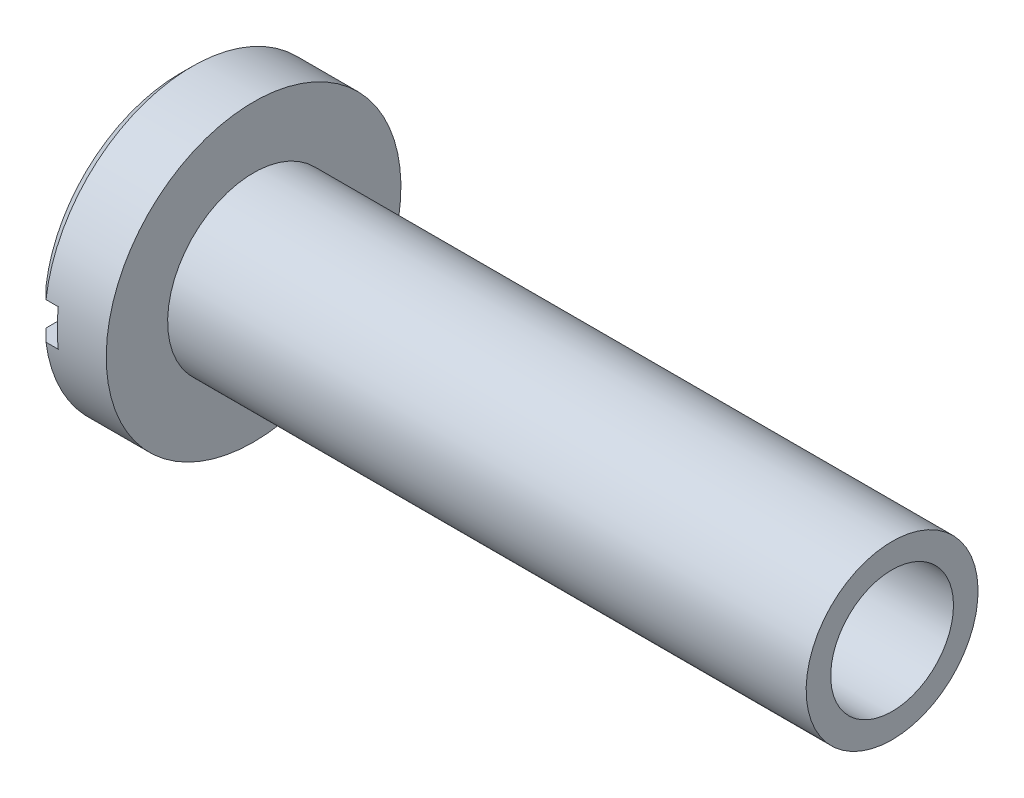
ISO-10303-21;
HEADER;
FILE_DESCRIPTION(('STEP AP214'),'2;1');
FILE_NAME('part.step','',(''),(''),'','','');
FILE_SCHEMA(('AUTOMOTIVE_DESIGN { 1 0 10303 214 1 1 1 1 }'));
ENDSEC;
DATA;
#1=APPLICATION_CONTEXT('core data for automotive mechanical design processes');
#2=APPLICATION_PROTOCOL_DEFINITION('international standard','automotive_design',2000,#1);
#3=PRODUCT_CONTEXT('',#1,'mechanical');
#4=PRODUCT('Part','Part','',(#3));
#5=PRODUCT_RELATED_PRODUCT_CATEGORY('part','',(#4));
#6=PRODUCT_DEFINITION_FORMATION('','',#4);
#7=PRODUCT_DEFINITION_CONTEXT('part definition',#1,'design');
#8=PRODUCT_DEFINITION('design','',#6,#7);
#9=PRODUCT_DEFINITION_SHAPE('','',#8);
#10=(LENGTH_UNIT() NAMED_UNIT(*) SI_UNIT(.MILLI.,.METRE.));
#11=(NAMED_UNIT(*) PLANE_ANGLE_UNIT() SI_UNIT($,.RADIAN.));
#12=(NAMED_UNIT(*) SI_UNIT($,.STERADIAN.) SOLID_ANGLE_UNIT());
#13=UNCERTAINTY_MEASURE_WITH_UNIT(LENGTH_MEASURE(1.E-05),#10,'distance_accuracy_value','');
#14=(GEOMETRIC_REPRESENTATION_CONTEXT(3) GLOBAL_UNCERTAINTY_ASSIGNED_CONTEXT((#13)) GLOBAL_UNIT_ASSIGNED_CONTEXT((#10,
#11,#12)) REPRESENTATION_CONTEXT('',''));
#15=CARTESIAN_POINT('',(0.,0.,0.));
#16=DIRECTION('',(0.,0.,1.));
#17=DIRECTION('',(1.,0.,0.));
#18=AXIS2_PLACEMENT_3D('',#15,#16,#17);
#19=CARTESIAN_POINT('',(0.,0.,0.));
#20=DIRECTION('',(0.999999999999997,0.,0.));
#21=DIRECTION('',(0.,1.,0.));
#22=AXIS2_PLACEMENT_3D('',#19,#20,#21);
#23=PLANE('',#22);
#24=DIRECTION('',(0.,0.,0.999999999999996));
#25=VECTOR('',#24,1.);
#26=CARTESIAN_POINT('',(0.,0.375000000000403,-2.99999999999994));
#27=LINE('',#26,#25);
#28=CARTESIAN_POINT('',(0.,0.375000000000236,-2.72431183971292));
#29=VERTEX_POINT('',#28);
#30=CARTESIAN_POINT('',(0.,0.374999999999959,2.72431183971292));
#31=VERTEX_POINT('',#30);
#32=EDGE_CURVE('E185',#29,#31,#27,.T.);
#33=ORIENTED_EDGE('',*,*,#32,.T.);
#34=CARTESIAN_POINT('',(0.,0.,0.));
#35=DIRECTION('',(0.999999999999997,0.,0.));
#36=DIRECTION('',(0.,1.,0.));
#37=AXIS2_PLACEMENT_3D('',#34,#35,#36);
#38=CIRCLE('',#37,2.75);
#39=EDGE_CURVE('E133',#31,#29,#38,.F.);
#40=ORIENTED_EDGE('',*,*,#39,.T.);
#41=EDGE_LOOP('',(#33,#40));
#42=FACE_BOUND('',#41,.T.);
#43=ADVANCED_FACE('F38',(#42),#23,.F.);
#44=DIRECTION('',(0.,0.,0.999999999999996));
#45=VECTOR('',#44,1.);
#46=CARTESIAN_POINT('',(0.,-0.375000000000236,-3.00000000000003));
#47=LINE('',#46,#45);
#48=CARTESIAN_POINT('',(0.,-0.375000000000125,-2.72431183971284));
#49=VERTEX_POINT('',#48);
#50=CARTESIAN_POINT('',(0.,-0.375000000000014,2.7243118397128));
#51=VERTEX_POINT('',#50);
#52=EDGE_CURVE('E114',#49,#51,#47,.T.);
#53=ORIENTED_EDGE('',*,*,#52,.F.);
#54=CARTESIAN_POINT('',(0.,0.,0.));
#55=DIRECTION('',(0.999999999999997,0.,0.));
#56=DIRECTION('',(0.,1.,0.));
#57=AXIS2_PLACEMENT_3D('',#54,#55,#56);
#58=CIRCLE('',#57,2.75);
#59=EDGE_CURVE('E167',#49,#51,#58,.F.);
#60=ORIENTED_EDGE('',*,*,#59,.T.);
#61=EDGE_LOOP('',(#53,#60));
#62=FACE_BOUND('',#61,.T.);
#63=ADVANCED_FACE('F40',(#62),#23,.F.);
#64=CARTESIAN_POINT('',(0.,0.,0.));
#65=DIRECTION('',(-0.999999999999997,0.,0.));
#66=DIRECTION('',(0.,-1.,0.));
#67=AXIS2_PLACEMENT_3D('',#64,#65,#66);
#68=CYLINDRICAL_SURFACE('',#67,3.);
#69=DIRECTION('',(-0.999999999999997,0.,0.));
#70=VECTOR('',#69,1.);
#71=CARTESIAN_POINT('',(0.,0.375000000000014,-2.97647022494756));
#72=LINE('',#71,#70);
#73=CARTESIAN_POINT('',(0.500000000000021,0.375000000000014,-2.97647022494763));
#74=VERTEX_POINT('',#73);
#75=CARTESIAN_POINT('',(0.250000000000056,0.374999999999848,-2.97647022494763));
#76=VERTEX_POINT('',#75);
#77=EDGE_CURVE('E129',#74,#76,#72,.T.);
#78=ORIENTED_EDGE('',*,*,#77,.T.);
#79=CARTESIAN_POINT('',(0.25,2.77555756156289E-13,0.));
#80=DIRECTION('',(0.999999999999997,0.,0.));
#81=DIRECTION('',(0.,1.,0.));
#82=AXIS2_PLACEMENT_3D('',#79,#80,#81);
#83=CIRCLE('',#82,3.);
#84=CARTESIAN_POINT('',(0.250000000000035,0.375000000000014,2.97647022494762));
#85=VERTEX_POINT('',#84);
#86=EDGE_CURVE('E191',#76,#85,#83,.T.);
#87=ORIENTED_EDGE('',*,*,#86,.T.);
#88=DIRECTION('',(-0.999999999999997,0.,0.));
#89=VECTOR('',#88,1.);
#90=CARTESIAN_POINT('',(0.,0.37500000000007,2.9764702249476));
#91=LINE('',#90,#89);
#92=CARTESIAN_POINT('',(0.500000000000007,0.374999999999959,2.9764702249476));
#93=VERTEX_POINT('',#92);
#94=EDGE_CURVE('E120',#85,#93,#91,.F.);
#95=ORIENTED_EDGE('',*,*,#94,.T.);
#96=CARTESIAN_POINT('',(0.500000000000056,1.11022302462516E-13,0.));
#97=DIRECTION('',(0.999999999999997,0.,0.));
#98=DIRECTION('',(0.,0.,-0.999999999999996));
#99=AXIS2_PLACEMENT_3D('',#96,#97,#98);
#100=CIRCLE('',#99,3.);
#101=CARTESIAN_POINT('',(0.499999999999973,-0.374999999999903,2.97647022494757));
#102=VERTEX_POINT('',#101);
#103=EDGE_CURVE('E106',#93,#102,#100,.T.);
#104=ORIENTED_EDGE('',*,*,#103,.T.);
#105=DIRECTION('',(-0.999999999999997,0.,0.));
#106=VECTOR('',#105,1.);
#107=CARTESIAN_POINT('',(0.,-0.37500000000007,2.97647022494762));
#108=LINE('',#107,#106);
#109=CARTESIAN_POINT('',(0.250000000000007,-0.374999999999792,2.97647022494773));
#110=VERTEX_POINT('',#109);
#111=EDGE_CURVE('E98',#102,#110,#108,.T.);
#112=ORIENTED_EDGE('',*,*,#111,.T.);
#113=CARTESIAN_POINT('',(0.25,2.77555756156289E-13,0.));
#114=DIRECTION('',(0.999999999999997,0.,0.));
#115=DIRECTION('',(0.,1.,0.));
#116=AXIS2_PLACEMENT_3D('',#113,#114,#115);
#117=CIRCLE('',#116,3.);
#118=CARTESIAN_POINT('',(0.249999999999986,-0.375000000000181,-2.97647022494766));
#119=VERTEX_POINT('',#118);
#120=EDGE_CURVE('E192',#110,#119,#117,.T.);
#121=ORIENTED_EDGE('',*,*,#120,.T.);
#122=DIRECTION('',(-0.999999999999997,0.,0.));
#123=VECTOR('',#122,1.);
#124=CARTESIAN_POINT('',(0.,-0.37500000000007,-2.97647022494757));
#125=LINE('',#124,#123);
#126=CARTESIAN_POINT('',(0.500000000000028,-0.375000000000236,-2.97647022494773));
#127=VERTEX_POINT('',#126);
#128=EDGE_CURVE('E126',#119,#127,#125,.F.);
#129=ORIENTED_EDGE('',*,*,#128,.T.);
#130=EDGE_CURVE('E105',#127,#74,#100,.T.);
#131=ORIENTED_EDGE('',*,*,#130,.T.);
#132=EDGE_LOOP('',(#78,#87,#95,#104,#112,#121,#129,#131));
#133=FACE_BOUND('',#132,.T.);
#134=CARTESIAN_POINT('',(1.50000000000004,1.66533453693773E-13,0.));
#135=DIRECTION('',(-0.999999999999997,0.,0.));
#136=DIRECTION('',(0.,-1.,0.));
#137=AXIS2_PLACEMENT_3D('',#134,#135,#136);
#138=CIRCLE('',#137,3.);
#139=CARTESIAN_POINT('',(1.50000000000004,-2.99999999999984,0.));
#140=VERTEX_POINT('',#139);
#141=EDGE_CURVE('E121',#140,#140,#138,.T.);
#142=ORIENTED_EDGE('',*,*,#141,.T.);
#143=EDGE_LOOP('',(#142));
#144=FACE_BOUND('',#143,.T.);
#145=ADVANCED_FACE('F117',(#133,#144),#68,.T.);
#146=CARTESIAN_POINT('',(1.49999999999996,3.00000000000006,-1.11022302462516E-13));
#147=DIRECTION('',(-0.999999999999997,0.,0.));
#148=DIRECTION('',(0.,-1.,0.));
#149=AXIS2_PLACEMENT_3D('',#146,#147,#148);
#150=PLANE('',#149);
#151=ORIENTED_EDGE('',*,*,#141,.F.);
#152=EDGE_LOOP('',(#151));
#153=FACE_BOUND('',#152,.T.);
#154=CARTESIAN_POINT('',(1.50000000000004,1.66533453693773E-13,0.));
#155=DIRECTION('',(-0.999999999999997,0.,0.));
#156=DIRECTION('',(0.,-1.,0.));
#157=AXIS2_PLACEMENT_3D('',#154,#155,#156);
#158=CIRCLE('',#157,1.75);
#159=CARTESIAN_POINT('',(1.50000000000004,-1.75,0.));
#160=VERTEX_POINT('',#159);
#161=EDGE_CURVE('E124',#160,#160,#158,.T.);
#162=ORIENTED_EDGE('',*,*,#161,.T.);
#163=EDGE_LOOP('',(#162));
#164=FACE_BOUND('',#163,.T.);
#165=ADVANCED_FACE('F213',(#153,#164),#150,.F.);
#166=CARTESIAN_POINT('',(0.,0.,0.));
#167=DIRECTION('',(-0.999999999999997,0.,0.));
#168=DIRECTION('',(0.,-1.,0.));
#169=AXIS2_PLACEMENT_3D('',#166,#167,#168);
#170=CYLINDRICAL_SURFACE('',#169,1.75);
#171=CARTESIAN_POINT('',(14.4999999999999,1.11022302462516E-13,1.38777878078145E-13));
#172=DIRECTION('',(-0.999999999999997,0.,0.));
#173=DIRECTION('',(0.,-1.,0.));
#174=AXIS2_PLACEMENT_3D('',#171,#172,#173);
#175=CIRCLE('',#174,1.75);
#176=CARTESIAN_POINT('',(14.4999999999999,-1.75000000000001,0.));
#177=VERTEX_POINT('',#176);
#178=EDGE_CURVE('E207',#177,#177,#175,.T.);
#179=CARTESIAN_POINT('',(1.50000000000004,-1.75,0.));
#180=CARTESIAN_POINT('',(1.63541666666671,-1.75,0.));
#181=CARTESIAN_POINT('',(1.77083333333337,-1.75,0.));
#182=CARTESIAN_POINT('',(2.0416666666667,-1.75,0.));
#183=CARTESIAN_POINT('',(2.17708333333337,-1.75,0.));
#184=CARTESIAN_POINT('',(2.4479166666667,-1.75,0.));
#185=CARTESIAN_POINT('',(2.58333333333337,-1.75,0.));
#186=CARTESIAN_POINT('',(2.8541666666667,-1.75,0.));
#187=CARTESIAN_POINT('',(2.98958333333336,-1.75,0.));
#188=CARTESIAN_POINT('',(3.26041666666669,-1.75,0.));
#189=CARTESIAN_POINT('',(3.39583333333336,-1.75,0.));
#190=CARTESIAN_POINT('',(3.66666666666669,-1.75,0.));
#191=CARTESIAN_POINT('',(3.80208333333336,-1.75000000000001,0.));
#192=CARTESIAN_POINT('',(4.07291666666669,-1.75000000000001,0.));
#193=CARTESIAN_POINT('',(4.20833333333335,-1.75000000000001,0.));
#194=CARTESIAN_POINT('',(4.47916666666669,-1.75000000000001,0.));
#195=CARTESIAN_POINT('',(4.61458333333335,-1.75000000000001,0.));
#196=CARTESIAN_POINT('',(4.88541666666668,-1.75000000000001,0.));
#197=CARTESIAN_POINT('',(5.02083333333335,-1.75000000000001,0.));
#198=CARTESIAN_POINT('',(5.29166666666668,-1.75000000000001,0.));
#199=CARTESIAN_POINT('',(5.42708333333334,-1.75000000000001,0.));
#200=CARTESIAN_POINT('',(5.69791666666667,-1.75000000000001,0.));
#201=CARTESIAN_POINT('',(5.83333333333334,-1.75000000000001,0.));
#202=CARTESIAN_POINT('',(6.10416666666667,-1.75000000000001,0.));
#203=CARTESIAN_POINT('',(6.23958333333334,-1.75000000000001,0.));
#204=CARTESIAN_POINT('',(6.51041666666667,-1.75000000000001,0.));
#205=CARTESIAN_POINT('',(6.64583333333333,-1.75000000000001,0.));
#206=CARTESIAN_POINT('',(6.91666666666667,-1.75000000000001,0.));
#207=CARTESIAN_POINT('',(7.05208333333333,-1.75000000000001,0.));
#208=CARTESIAN_POINT('',(7.32291666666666,-1.75000000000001,0.));
#209=CARTESIAN_POINT('',(7.45833333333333,-1.75000000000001,0.));
#210=CARTESIAN_POINT('',(7.72916666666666,-1.75000000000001,0.));
#211=CARTESIAN_POINT('',(7.86458333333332,-1.75000000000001,0.));
#212=CARTESIAN_POINT('',(8.13541666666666,-1.75000000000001,0.));
#213=CARTESIAN_POINT('',(8.27083333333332,-1.75000000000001,0.));
#214=CARTESIAN_POINT('',(8.54166666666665,-1.75000000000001,0.));
#215=CARTESIAN_POINT('',(8.67708333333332,-1.75000000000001,0.));
#216=CARTESIAN_POINT('',(8.94791666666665,-1.75000000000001,0.));
#217=CARTESIAN_POINT('',(9.08333333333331,-1.75000000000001,0.));
#218=CARTESIAN_POINT('',(9.35416666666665,-1.75000000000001,0.));
#219=CARTESIAN_POINT('',(9.48958333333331,-1.75000000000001,0.));
#220=CARTESIAN_POINT('',(9.76041666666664,-1.75000000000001,0.));
#221=CARTESIAN_POINT('',(9.89583333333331,-1.75000000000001,0.));
#222=CARTESIAN_POINT('',(10.1666666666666,-1.75000000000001,0.));
#223=CARTESIAN_POINT('',(10.3020833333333,-1.75000000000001,0.));
#224=CARTESIAN_POINT('',(10.5729166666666,-1.75000000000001,0.));
#225=CARTESIAN_POINT('',(10.7083333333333,-1.75000000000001,0.));
#226=CARTESIAN_POINT('',(10.9791666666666,-1.75000000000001,0.));
#227=CARTESIAN_POINT('',(11.1145833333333,-1.75000000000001,0.));
#228=CARTESIAN_POINT('',(11.3854166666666,-1.75000000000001,0.));
#229=CARTESIAN_POINT('',(11.5208333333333,-1.75000000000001,0.));
#230=CARTESIAN_POINT('',(11.7916666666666,-1.75000000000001,0.));
#231=CARTESIAN_POINT('',(11.9270833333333,-1.75000000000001,0.));
#232=CARTESIAN_POINT('',(12.1979166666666,-1.75000000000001,0.));
#233=CARTESIAN_POINT('',(12.3333333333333,-1.75000000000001,0.));
#234=CARTESIAN_POINT('',(12.6041666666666,-1.75000000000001,0.));
#235=CARTESIAN_POINT('',(12.7395833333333,-1.75000000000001,0.));
#236=CARTESIAN_POINT('',(13.0104166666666,-1.75000000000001,0.));
#237=CARTESIAN_POINT('',(13.1458333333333,-1.75000000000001,0.));
#238=CARTESIAN_POINT('',(13.4166666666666,-1.75000000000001,0.));
#239=CARTESIAN_POINT('',(13.5520833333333,-1.75000000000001,0.));
#240=CARTESIAN_POINT('',(13.8229166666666,-1.75000000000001,0.));
#241=CARTESIAN_POINT('',(13.9583333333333,-1.75000000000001,0.));
#242=CARTESIAN_POINT('',(14.2291666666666,-1.75000000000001,0.));
#243=CARTESIAN_POINT('',(14.3645833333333,-1.75000000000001,0.));
#244=CARTESIAN_POINT('',(14.4999999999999,-1.75000000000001,0.));
#245=B_SPLINE_CURVE_WITH_KNOTS('',3,(#179,#180,#181,#182,#183,#184,#185,#186,#187,#188,#189,
#190,#191,#192,#193,#194,#195,#196,#197,#198,#199,#200,#201,#202,#203,#204,#205,#206,#207,#208,
#209,#210,#211,#212,#213,#214,#215,#216,#217,#218,#219,#220,#221,#222,#223,#224,#225,#226,#227,
#228,#229,#230,#231,#232,#233,#234,#235,#236,#237,#238,#239,#240,#241,#242,#243,#244),
.UNSPECIFIED.,.F.,.F.,(4,2,2,2,2,2,2,2,2,2,2,2,2,2,2,2,2,2,2,2,2,2,2,2,2,2,2,2,2,2,2,2,4),(0.,
0.406249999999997,0.812499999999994,1.21874999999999,1.62499999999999,2.03124999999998,
2.43749999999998,2.84374999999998,3.24999999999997,3.65624999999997,4.06249999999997,
4.46874999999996,4.87499999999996,5.28124999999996,5.68749999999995,6.09374999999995,
6.49999999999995,6.90624999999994,7.31249999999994,7.71874999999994,8.12499999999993,
8.53124999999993,8.93749999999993,9.34374999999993,9.74999999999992,10.1562499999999,
10.5624999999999,10.9687499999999,11.3749999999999,11.7812499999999,12.1874999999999,
12.5937499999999,12.9999999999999),.UNSPECIFIED.);
#246=EDGE_CURVE('BSEAM215',#160,#177,#245,.T.);
#247=ORIENTED_EDGE('',*,*,#161,.F.);
#248=ORIENTED_EDGE('',*,*,#178,.T.);
#249=ORIENTED_EDGE('',*,*,#246,.T.);
#250=ORIENTED_EDGE('',*,*,#246,.F.);
#251=EDGE_LOOP('',(#247,#249,#248,#250));
#252=FACE_BOUND('',#251,.T.);
#253=ADVANCED_FACE('F215',(#252),#170,.T.);
#254=CARTESIAN_POINT('',(14.5,1.75000000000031,0.));
#255=DIRECTION('',(-0.999999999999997,0.,0.));
#256=DIRECTION('',(0.,-1.,0.));
#257=AXIS2_PLACEMENT_3D('',#254,#255,#256);
#258=PLANE('',#257);
#259=CARTESIAN_POINT('',(14.4999999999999,1.11022302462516E-13,1.38777878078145E-13));
#260=DIRECTION('',(0.999999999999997,0.,0.));
#261=DIRECTION('',(0.,0.,-0.999999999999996));
#262=AXIS2_PLACEMENT_3D('',#259,#260,#261);
#263=CIRCLE('',#262,1.25);
#264=CARTESIAN_POINT('',(14.4999999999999,1.12886130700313E-13,-1.24999999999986));
#265=VERTEX_POINT('',#264);
#266=EDGE_CURVE('E204',#265,#265,#263,.T.);
#267=ORIENTED_EDGE('',*,*,#266,.F.);
#268=EDGE_LOOP('',(#267));
#269=FACE_BOUND('',#268,.T.);
#270=ORIENTED_EDGE('',*,*,#178,.F.);
#271=EDGE_LOOP('',(#270));
#272=FACE_BOUND('',#271,.T.);
#273=ADVANCED_FACE('F218',(#269,#272),#258,.F.);
#274=CARTESIAN_POINT('',(14.4999999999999,1.11022302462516E-13,1.38777878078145E-13));
#275=DIRECTION('',(0.999999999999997,0.,0.));
#276=DIRECTION('',(0.,0.,-0.999999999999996));
#277=AXIS2_PLACEMENT_3D('',#274,#275,#276);
#278=CYLINDRICAL_SURFACE('',#277,1.25);
#279=CARTESIAN_POINT('',(8.50000000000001,2.77555756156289E-13,0.));
#280=DIRECTION('',(0.999999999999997,0.,0.));
#281=DIRECTION('',(0.,0.,-0.999999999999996));
#282=AXIS2_PLACEMENT_3D('',#279,#280,#281);
#283=CIRCLE('',#282,1.25);
#284=CARTESIAN_POINT('',(8.50000000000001,1.15947849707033E-13,-1.24999999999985));
#285=VERTEX_POINT('',#284);
#286=EDGE_CURVE('E201',#285,#285,#283,.T.);
#287=CARTESIAN_POINT('',(8.50000000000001,1.15947849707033E-13,-1.24999999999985));
#288=CARTESIAN_POINT('',(8.56250000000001,1.15915956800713E-13,-1.24999999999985));
#289=CARTESIAN_POINT('',(8.62500000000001,1.15884063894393E-13,-1.24999999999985));
#290=CARTESIAN_POINT('',(8.75000000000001,1.15820278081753E-13,-1.24999999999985));
#291=CARTESIAN_POINT('',(8.8125,1.15788385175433E-13,-1.24999999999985));
#292=CARTESIAN_POINT('',(8.9375,1.15724599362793E-13,-1.24999999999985));
#293=CARTESIAN_POINT('',(9.,1.15692706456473E-13,-1.24999999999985));
#294=CARTESIAN_POINT('',(9.125,1.15628920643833E-13,-1.24999999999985));
#295=CARTESIAN_POINT('',(9.1875,1.15597027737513E-13,-1.24999999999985));
#296=CARTESIAN_POINT('',(9.3125,1.15533241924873E-13,-1.24999999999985));
#297=CARTESIAN_POINT('',(9.375,1.15501349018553E-13,-1.24999999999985));
#298=CARTESIAN_POINT('',(9.5,1.15437563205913E-13,-1.24999999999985));
#299=CARTESIAN_POINT('',(9.5625,1.15405670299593E-13,-1.24999999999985));
#300=CARTESIAN_POINT('',(9.68749999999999,1.15341884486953E-13,-1.24999999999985));
#301=CARTESIAN_POINT('',(9.74999999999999,1.15309991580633E-13,-1.24999999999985));
#302=CARTESIAN_POINT('',(9.87499999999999,1.15246205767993E-13,-1.24999999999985));
#303=CARTESIAN_POINT('',(9.93749999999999,1.15214312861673E-13,-1.24999999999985));
#304=CARTESIAN_POINT('',(10.0625,1.15150527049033E-13,-1.24999999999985));
#305=CARTESIAN_POINT('',(10.125,1.15118634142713E-13,-1.24999999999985));
#306=CARTESIAN_POINT('',(10.25,1.15054848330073E-13,-1.24999999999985));
#307=CARTESIAN_POINT('',(10.3125,1.15022955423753E-13,-1.24999999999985));
#308=CARTESIAN_POINT('',(10.4375,1.14959169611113E-13,-1.24999999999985));
#309=CARTESIAN_POINT('',(10.5,1.14927276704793E-13,-1.24999999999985));
#310=CARTESIAN_POINT('',(10.625,1.14863490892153E-13,-1.24999999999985));
#311=CARTESIAN_POINT('',(10.6875,1.14831597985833E-13,-1.24999999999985));
#312=CARTESIAN_POINT('',(10.8125,1.14767812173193E-13,-1.24999999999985));
#313=CARTESIAN_POINT('',(10.875,1.14735919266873E-13,-1.24999999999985));
#314=CARTESIAN_POINT('',(11.,1.14672133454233E-13,-1.24999999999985));
#315=CARTESIAN_POINT('',(11.0625,1.14640240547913E-13,-1.24999999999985));
#316=CARTESIAN_POINT('',(11.1875,1.14576454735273E-13,-1.24999999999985));
#317=CARTESIAN_POINT('',(11.25,1.14544561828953E-13,-1.24999999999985));
#318=CARTESIAN_POINT('',(11.375,1.14480776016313E-13,-1.24999999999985));
#319=CARTESIAN_POINT('',(11.4375,1.14448883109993E-13,-1.24999999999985));
#320=CARTESIAN_POINT('',(11.5625,1.14385097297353E-13,-1.24999999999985));
#321=CARTESIAN_POINT('',(11.625,1.14353204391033E-13,-1.24999999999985));
#322=CARTESIAN_POINT('',(11.75,1.14289418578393E-13,-1.24999999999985));
#323=CARTESIAN_POINT('',(11.8125,1.14257525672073E-13,-1.24999999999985));
#324=CARTESIAN_POINT('',(11.9375,1.14193739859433E-13,-1.24999999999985));
#325=CARTESIAN_POINT('',(12.,1.14161846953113E-13,-1.24999999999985));
#326=CARTESIAN_POINT('',(12.125,1.14098061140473E-13,-1.24999999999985));
#327=CARTESIAN_POINT('',(12.1875,1.14066168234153E-13,-1.24999999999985));
#328=CARTESIAN_POINT('',(12.3125,1.14002382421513E-13,-1.24999999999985));
#329=CARTESIAN_POINT('',(12.375,1.13970489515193E-13,-1.24999999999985));
#330=CARTESIAN_POINT('',(12.5,1.13906703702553E-13,-1.24999999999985));
#331=CARTESIAN_POINT('',(12.5625,1.13874810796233E-13,-1.24999999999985));
#332=CARTESIAN_POINT('',(12.6875,1.13811024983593E-13,-1.24999999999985));
#333=CARTESIAN_POINT('',(12.75,1.13779132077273E-13,-1.24999999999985));
#334=CARTESIAN_POINT('',(12.875,1.13715346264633E-13,-1.24999999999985));
#335=CARTESIAN_POINT('',(12.9375,1.13683453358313E-13,-1.24999999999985));
#336=CARTESIAN_POINT('',(13.0625,1.13619667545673E-13,-1.24999999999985));
#337=CARTESIAN_POINT('',(13.125,1.13587774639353E-13,-1.24999999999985));
#338=CARTESIAN_POINT('',(13.25,1.13523988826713E-13,-1.24999999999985));
#339=CARTESIAN_POINT('',(13.3125,1.13492095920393E-13,-1.24999999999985));
#340=CARTESIAN_POINT('',(13.4375,1.13428310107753E-13,-1.24999999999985));
#341=CARTESIAN_POINT('',(13.5,1.13396417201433E-13,-1.24999999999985));
#342=CARTESIAN_POINT('',(13.6249999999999,1.13332631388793E-13,-1.24999999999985));
#343=CARTESIAN_POINT('',(13.6874999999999,1.13300738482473E-13,-1.24999999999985));
#344=CARTESIAN_POINT('',(13.8124999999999,1.13236952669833E-13,-1.24999999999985));
#345=CARTESIAN_POINT('',(13.8749999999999,1.13205059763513E-13,-1.24999999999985));
#346=CARTESIAN_POINT('',(13.9999999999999,1.13141273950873E-13,-1.24999999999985));
#347=CARTESIAN_POINT('',(14.0624999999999,1.13109381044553E-13,-1.24999999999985));
#348=CARTESIAN_POINT('',(14.1874999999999,1.13045595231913E-13,-1.24999999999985));
#349=CARTESIAN_POINT('',(14.2499999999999,1.13013702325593E-13,-1.24999999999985));
#350=CARTESIAN_POINT('',(14.3749999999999,1.12949916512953E-13,-1.24999999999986));
#351=CARTESIAN_POINT('',(14.4374999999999,1.12918023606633E-13,-1.24999999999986));
#352=CARTESIAN_POINT('',(14.4999999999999,1.12886130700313E-13,-1.24999999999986));
#353=B_SPLINE_CURVE_WITH_KNOTS('',3,(#287,#288,#289,#290,#291,#292,#293,#294,#295,#296,#297,
#298,#299,#300,#301,#302,#303,#304,#305,#306,#307,#308,#309,#310,#311,#312,#313,#314,#315,#316,
#317,#318,#319,#320,#321,#322,#323,#324,#325,#326,#327,#328,#329,#330,#331,#332,#333,#334,#335,
#336,#337,#338,#339,#340,#341,#342,#343,#344,#345,#346,#347,#348,#349,#350,#351,#352),
.UNSPECIFIED.,.F.,.F.,(4,2,2,2,2,2,2,2,2,2,2,2,2,2,2,2,2,2,2,2,2,2,2,2,2,2,2,2,2,2,2,2,4),(0.,
0.187499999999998,0.374999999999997,0.562499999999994,0.749999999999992,0.93749999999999,
1.12499999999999,1.31249999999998,1.49999999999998,1.68749999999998,1.87499999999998,
2.06249999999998,2.24999999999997,2.43749999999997,2.62499999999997,2.81249999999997,
2.99999999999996,3.18749999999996,3.37499999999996,3.56249999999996,3.74999999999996,
3.93749999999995,4.12499999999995,4.31249999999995,4.49999999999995,4.68749999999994,
4.87499999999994,5.06249999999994,5.24999999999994,5.43749999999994,5.62499999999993,
5.81249999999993,5.99999999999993),.UNSPECIFIED.);
#354=EDGE_CURVE('BSEAM223',#285,#265,#353,.T.);
#355=ORIENTED_EDGE('',*,*,#286,.F.);
#356=ORIENTED_EDGE('',*,*,#266,.T.);
#357=ORIENTED_EDGE('',*,*,#354,.T.);
#358=ORIENTED_EDGE('',*,*,#354,.F.);
#359=EDGE_LOOP('',(#355,#357,#356,#358));
#360=FACE_BOUND('',#359,.T.);
#361=ADVANCED_FACE('F223',(#360),#278,.F.);
#362=CARTESIAN_POINT('',(8.49999999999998,1.02500000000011,0.));
#363=DIRECTION('',(-0.999999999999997,0.,0.));
#364=DIRECTION('',(0.,0.,0.999999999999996));
#365=AXIS2_PLACEMENT_3D('',#362,#363,#364);
#366=PLANE('',#365);
#367=CARTESIAN_POINT('',(8.50000000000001,2.77555756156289E-13,0.));
#368=DIRECTION('',(0.999999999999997,0.,0.));
#369=DIRECTION('',(0.,0.,-0.999999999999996));
#370=AXIS2_PLACEMENT_3D('',#367,#368,#369);
#371=CIRCLE('',#370,1.025);
#372=CARTESIAN_POINT('',(8.50000000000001,1.1561236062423E-13,-1.02499999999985));
#373=VERTEX_POINT('',#372);
#374=EDGE_CURVE('E198',#373,#373,#371,.T.);
#375=ORIENTED_EDGE('',*,*,#374,.F.);
#376=EDGE_LOOP('',(#375));
#377=FACE_BOUND('',#376,.T.);
#378=ORIENTED_EDGE('',*,*,#286,.T.);
#379=EDGE_LOOP('',(#378));
#380=FACE_BOUND('',#379,.T.);
#381=ADVANCED_FACE('F229',(#377,#380),#366,.F.);
#382=CARTESIAN_POINT('',(14.4999999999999,1.11022302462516E-13,1.38777878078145E-13));
#383=DIRECTION('',(0.999999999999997,0.,0.));
#384=DIRECTION('',(0.,0.,-0.999999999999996));
#385=AXIS2_PLACEMENT_3D('',#382,#383,#384);
#386=CYLINDRICAL_SURFACE('',#385,1.025);
#387=CARTESIAN_POINT('',(7.14999999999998,0.,0.));
#388=DIRECTION('',(0.999999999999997,0.,0.));
#389=DIRECTION('',(0.,0.,-0.999999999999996));
#390=AXIS2_PLACEMENT_3D('',#387,#388,#389);
#391=CIRCLE('',#390,1.025);
#392=CARTESIAN_POINT('',(7.14999999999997,1.16301247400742E-13,-1.02499999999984));
#393=VERTEX_POINT('',#392);
#394=EDGE_CURVE('E187',#393,#393,#391,.T.);
#395=CARTESIAN_POINT('',(7.14999999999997,1.16301247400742E-13,-1.02499999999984));
#396=CARTESIAN_POINT('',(7.16406249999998,1.1629407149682E-13,-1.02499999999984));
#397=CARTESIAN_POINT('',(7.17812499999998,1.16286895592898E-13,-1.02499999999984));
#398=CARTESIAN_POINT('',(7.20624999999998,1.16272543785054E-13,-1.02499999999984));
#399=CARTESIAN_POINT('',(7.22031249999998,1.16265367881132E-13,-1.02499999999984));
#400=CARTESIAN_POINT('',(7.24843749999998,1.16251016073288E-13,-1.02499999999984));
#401=CARTESIAN_POINT('',(7.26249999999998,1.16243840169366E-13,-1.02499999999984));
#402=CARTESIAN_POINT('',(7.29062499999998,1.16229488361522E-13,-1.02499999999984));
#403=CARTESIAN_POINT('',(7.30468749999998,1.162223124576E-13,-1.02499999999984));
#404=CARTESIAN_POINT('',(7.33281249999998,1.16207960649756E-13,-1.02499999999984));
#405=CARTESIAN_POINT('',(7.34687499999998,1.16200784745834E-13,-1.02499999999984));
#406=CARTESIAN_POINT('',(7.37499999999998,1.1618643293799E-13,-1.02499999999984));
#407=CARTESIAN_POINT('',(7.38906249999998,1.16179257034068E-13,-1.02499999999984));
#408=CARTESIAN_POINT('',(7.41718749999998,1.16164905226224E-13,-1.02499999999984));
#409=CARTESIAN_POINT('',(7.43124999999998,1.16157729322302E-13,-1.02499999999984));
#410=CARTESIAN_POINT('',(7.45937499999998,1.16143377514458E-13,-1.02499999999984));
#411=CARTESIAN_POINT('',(7.47343749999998,1.16136201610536E-13,-1.02499999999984));
#412=CARTESIAN_POINT('',(7.50156249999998,1.16121849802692E-13,-1.02499999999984));
#413=CARTESIAN_POINT('',(7.51562499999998,1.1611467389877E-13,-1.02499999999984));
#414=CARTESIAN_POINT('',(7.54374999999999,1.16100322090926E-13,-1.02499999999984));
#415=CARTESIAN_POINT('',(7.55781249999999,1.16093146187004E-13,-1.02499999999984));
#416=CARTESIAN_POINT('',(7.58593749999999,1.1607879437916E-13,-1.02499999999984));
#417=CARTESIAN_POINT('',(7.59999999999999,1.16071618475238E-13,-1.02499999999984));
#418=CARTESIAN_POINT('',(7.62812499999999,1.16057266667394E-13,-1.02499999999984));
#419=CARTESIAN_POINT('',(7.64218749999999,1.16050090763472E-13,-1.02499999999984));
#420=CARTESIAN_POINT('',(7.67031249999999,1.16035738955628E-13,-1.02499999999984));
#421=CARTESIAN_POINT('',(7.68437499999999,1.16028563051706E-13,-1.02499999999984));
#422=CARTESIAN_POINT('',(7.71249999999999,1.16014211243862E-13,-1.02499999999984));
#423=CARTESIAN_POINT('',(7.72656249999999,1.1600703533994E-13,-1.02499999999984));
#424=CARTESIAN_POINT('',(7.75468749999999,1.15992683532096E-13,-1.02499999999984));
#425=CARTESIAN_POINT('',(7.76874999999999,1.15985507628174E-13,-1.02499999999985));
#426=CARTESIAN_POINT('',(7.79687499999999,1.1597115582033E-13,-1.02499999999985));
#427=CARTESIAN_POINT('',(7.81093749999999,1.15963979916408E-13,-1.02499999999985));
#428=CARTESIAN_POINT('',(7.83906249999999,1.15949628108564E-13,-1.02499999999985));
#429=CARTESIAN_POINT('',(7.85312499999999,1.15942452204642E-13,-1.02499999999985));
#430=CARTESIAN_POINT('',(7.88124999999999,1.15928100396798E-13,-1.02499999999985));
#431=CARTESIAN_POINT('',(7.8953125,1.15920924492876E-13,-1.02499999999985));
#432=CARTESIAN_POINT('',(7.9234375,1.15906572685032E-13,-1.02499999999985));
#433=CARTESIAN_POINT('',(7.93749999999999,1.1589939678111E-13,-1.02499999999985));
#434=CARTESIAN_POINT('',(7.96562499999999,1.15885044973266E-13,-1.02499999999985));
#435=CARTESIAN_POINT('',(7.9796875,1.15877869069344E-13,-1.02499999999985));
#436=CARTESIAN_POINT('',(8.0078125,1.158635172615E-13,-1.02499999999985));
#437=CARTESIAN_POINT('',(8.021875,1.15856341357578E-13,-1.02499999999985));
#438=CARTESIAN_POINT('',(8.05,1.15841989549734E-13,-1.02499999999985));
#439=CARTESIAN_POINT('',(8.0640625,1.15834813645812E-13,-1.02499999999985));
#440=CARTESIAN_POINT('',(8.0921875,1.15820461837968E-13,-1.02499999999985));
#441=CARTESIAN_POINT('',(8.10625,1.15813285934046E-13,-1.02499999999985));
#442=CARTESIAN_POINT('',(8.134375,1.15798934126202E-13,-1.02499999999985));
#443=CARTESIAN_POINT('',(8.1484375,1.1579175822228E-13,-1.02499999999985));
#444=CARTESIAN_POINT('',(8.1765625,1.15777406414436E-13,-1.02499999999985));
#445=CARTESIAN_POINT('',(8.190625,1.15770230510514E-13,-1.02499999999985));
#446=CARTESIAN_POINT('',(8.21875,1.1575587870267E-13,-1.02499999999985));
#447=CARTESIAN_POINT('',(8.2328125,1.15748702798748E-13,-1.02499999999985));
#448=CARTESIAN_POINT('',(8.2609375,1.15734350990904E-13,-1.02499999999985));
#449=CARTESIAN_POINT('',(8.275,1.15727175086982E-13,-1.02499999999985));
#450=CARTESIAN_POINT('',(8.303125,1.15712823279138E-13,-1.02499999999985));
#451=CARTESIAN_POINT('',(8.3171875,1.15705647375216E-13,-1.02499999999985));
#452=CARTESIAN_POINT('',(8.34531250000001,1.15691295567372E-13,-1.02499999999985));
#453=CARTESIAN_POINT('',(8.35937500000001,1.1568411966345E-13,-1.02499999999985));
#454=CARTESIAN_POINT('',(8.38750000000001,1.15669767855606E-13,-1.02499999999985));
#455=CARTESIAN_POINT('',(8.40156250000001,1.15662591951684E-13,-1.02499999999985));
#456=CARTESIAN_POINT('',(8.42968750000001,1.1564824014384E-13,-1.02499999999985));
#457=CARTESIAN_POINT('',(8.44375000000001,1.15641064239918E-13,-1.02499999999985));
#458=CARTESIAN_POINT('',(8.47187500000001,1.15626712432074E-13,-1.02499999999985));
#459=CARTESIAN_POINT('',(8.48593750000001,1.15619536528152E-13,-1.02499999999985));
#460=CARTESIAN_POINT('',(8.50000000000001,1.1561236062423E-13,-1.02499999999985));
#461=B_SPLINE_CURVE_WITH_KNOTS('',3,(#395,#396,#397,#398,#399,#400,#401,#402,#403,#404,#405,
#406,#407,#408,#409,#410,#411,#412,#413,#414,#415,#416,#417,#418,#419,#420,#421,#422,#423,#424,
#425,#426,#427,#428,#429,#430,#431,#432,#433,#434,#435,#436,#437,#438,#439,#440,#441,#442,#443,
#444,#445,#446,#447,#448,#449,#450,#451,#452,#453,#454,#455,#456,#457,#458,#459,#460),
.UNSPECIFIED.,.F.,.F.,(4,2,2,2,2,2,2,2,2,2,2,2,2,2,2,2,2,2,2,2,2,2,2,2,2,2,2,2,2,2,2,2,4),(0.,
0.0421875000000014,0.0843750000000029,0.126562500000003,0.168750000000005,0.210937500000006,
0.253125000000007,0.295312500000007,0.337500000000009,0.37968750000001,0.421875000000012,
0.464062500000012,0.506250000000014,0.548437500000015,0.590625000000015,0.632812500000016,
0.675000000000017,0.717187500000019,0.759375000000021,0.80156250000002,0.843750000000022,
0.885937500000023,0.928125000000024,0.970312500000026,1.01250000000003,1.05468750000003,
1.09687500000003,1.13906250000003,1.18125000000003,1.22343750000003,1.26562500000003,
1.30781250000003,1.35000000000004),.UNSPECIFIED.);
#462=EDGE_CURVE('BSEAM269',#393,#373,#461,.T.);
#463=ORIENTED_EDGE('',*,*,#394,.F.);
#464=ORIENTED_EDGE('',*,*,#374,.T.);
#465=ORIENTED_EDGE('',*,*,#462,.T.);
#466=ORIENTED_EDGE('',*,*,#462,.F.);
#467=EDGE_LOOP('',(#463,#465,#464,#466));
#468=FACE_BOUND('',#467,.T.);
#469=ADVANCED_FACE('F269',(#468),#386,.F.);
#470=CARTESIAN_POINT('',(7.14999999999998,0.,0.));
#471=DIRECTION('',(0.999999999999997,0.,0.));
#472=DIRECTION('',(0.,0.,-0.999999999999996));
#473=AXIS2_PLACEMENT_3D('',#470,#471,#472);
#474=CONICAL_SURFACE('',#473,1.025,1.02974425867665);
#475=CARTESIAN_POINT('',(6.53411786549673,0.,0.));
#476=VERTEX_POINT('',#475);
#477=VERTEX_LOOP('',#476);
#478=FACE_BOUND('',#477,.T.);
#479=ORIENTED_EDGE('',*,*,#394,.T.);
#480=EDGE_LOOP('',(#479));
#481=FACE_BOUND('',#480,.T.);
#482=ADVANCED_FACE('F154',(#478,#481),#474,.F.);
#483=CARTESIAN_POINT('',(0.,0.375000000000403,-2.99999999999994));
#484=DIRECTION('',(0.,1.,0.));
#485=DIRECTION('',(-0.999999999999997,0.,0.));
#486=AXIS2_PLACEMENT_3D('',#483,#484,#485);
#487=PLANE('',#486);
#488=ORIENTED_EDGE('',*,*,#32,.F.);
#489=CARTESIAN_POINT('',(0.,0.375000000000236,-2.72431183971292));
#490=CARTESIAN_POINT('',(0.0416508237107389,0.375000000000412,-2.76635394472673));
#491=CARTESIAN_POINT('',(0.083309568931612,0.375000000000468,-2.80838819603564));
#492=CARTESIAN_POINT('',(0.166642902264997,0.375000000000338,-2.89244099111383));
#493=CARTESIAN_POINT('',(0.208317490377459,0.375000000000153,-2.93445953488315));
#494=CARTESIAN_POINT('',(0.250000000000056,0.374999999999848,-2.97647022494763));
#495=B_SPLINE_CURVE_WITH_KNOTS('',3,(#489,#490,#491,#492,#493,#494),.UNSPECIFIED.,.F.,.F.,(4,2,
4),(0.,0.17754144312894,0.355082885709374),.UNSPECIFIED.);
#496=EDGE_CURVE('E143',#29,#76,#495,.T.);
#497=ORIENTED_EDGE('',*,*,#496,.T.);
#498=ORIENTED_EDGE('',*,*,#77,.F.);
#499=DIRECTION('',(0.,0.,0.999999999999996));
#500=VECTOR('',#499,1.);
#501=CARTESIAN_POINT('',(0.5,0.375000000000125,-3.00000000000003));
#502=LINE('',#501,#500);
#503=EDGE_CURVE('E113',#74,#93,#502,.T.);
#504=ORIENTED_EDGE('',*,*,#503,.T.);
#505=ORIENTED_EDGE('',*,*,#94,.F.);
#506=CARTESIAN_POINT('',(0.250000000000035,0.375000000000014,2.97647022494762));
#507=CARTESIAN_POINT('',(0.208317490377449,0.375000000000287,2.93445953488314));
#508=CARTESIAN_POINT('',(0.166642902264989,0.375000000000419,2.89244099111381));
#509=CARTESIAN_POINT('',(0.0833095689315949,0.375000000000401,2.80838819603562));
#510=CARTESIAN_POINT('',(0.0416508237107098,0.37500000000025,2.76635394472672));
#511=CARTESIAN_POINT('',(0.,0.374999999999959,2.72431183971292));
#512=B_SPLINE_CURVE_WITH_KNOTS('',3,(#506,#507,#508,#509,#510,#511),.UNSPECIFIED.,.F.,.F.,(4,2,
4),(0.,0.177541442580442,0.355082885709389),.UNSPECIFIED.);
#513=EDGE_CURVE('E136',#85,#31,#512,.T.);
#514=ORIENTED_EDGE('',*,*,#513,.T.);
#515=EDGE_LOOP('',(#488,#497,#498,#504,#505,#514));
#516=FACE_BOUND('',#515,.T.);
#517=ADVANCED_FACE('F150',(#516),#487,.F.);
#518=CARTESIAN_POINT('',(0.5,0.375000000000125,-3.00000000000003));
#519=DIRECTION('',(0.999999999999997,0.,0.));
#520=DIRECTION('',(0.,0.,-0.999999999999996));
#521=AXIS2_PLACEMENT_3D('',#518,#519,#520);
#522=PLANE('',#521);
#523=ORIENTED_EDGE('',*,*,#503,.F.);
#524=ORIENTED_EDGE('',*,*,#130,.F.);
#525=DIRECTION('',(0.,0.,0.999999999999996));
#526=VECTOR('',#525,1.);
#527=CARTESIAN_POINT('',(0.500000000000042,-0.374999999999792,-3.));
#528=LINE('',#527,#526);
#529=EDGE_CURVE('E101',#127,#102,#528,.T.);
#530=ORIENTED_EDGE('',*,*,#529,.T.);
#531=ORIENTED_EDGE('',*,*,#103,.F.);
#532=EDGE_LOOP('',(#523,#524,#530,#531));
#533=FACE_BOUND('',#532,.T.);
#534=ADVANCED_FACE('F111',(#533),#522,.F.);
#535=CARTESIAN_POINT('',(0.,-0.375000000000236,-3.00000000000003));
#536=DIRECTION('',(0.,-1.,0.));
#537=DIRECTION('',(0.999999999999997,0.,0.));
#538=AXIS2_PLACEMENT_3D('',#535,#536,#537);
#539=PLANE('',#538);
#540=ORIENTED_EDGE('',*,*,#52,.T.);
#541=CARTESIAN_POINT('',(0.,-0.375000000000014,2.7243118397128));
#542=CARTESIAN_POINT('',(0.0416508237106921,-0.375000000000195,2.76635394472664));
#543=CARTESIAN_POINT('',(0.0833095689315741,-0.375000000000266,2.80838819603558));
#544=CARTESIAN_POINT('',(0.166642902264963,-0.375000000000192,2.89244099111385));
#545=CARTESIAN_POINT('',(0.208317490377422,-0.375000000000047,2.93445953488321));
#546=CARTESIAN_POINT('',(0.250000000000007,-0.374999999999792,2.97647022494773));
#547=B_SPLINE_CURVE_WITH_KNOTS('',3,(#541,#542,#543,#544,#545,#546),.UNSPECIFIED.,.F.,.F.,(4,2,
4),(0.,0.177541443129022,0.355082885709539),.UNSPECIFIED.);
#548=EDGE_CURVE('E11',#51,#110,#547,.T.);
#549=ORIENTED_EDGE('',*,*,#548,.T.);
#550=ORIENTED_EDGE('',*,*,#111,.F.);
#551=ORIENTED_EDGE('',*,*,#529,.F.);
#552=ORIENTED_EDGE('',*,*,#128,.F.);
#553=CARTESIAN_POINT('',(0.249999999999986,-0.375000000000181,-2.97647022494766));
#554=CARTESIAN_POINT('',(0.208317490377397,-0.375000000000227,-2.93445953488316));
#555=CARTESIAN_POINT('',(0.166642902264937,-0.375000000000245,-2.89244099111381));
#556=CARTESIAN_POINT('',(0.0833095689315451,-0.375000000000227,-2.80838819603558));
#557=CARTESIAN_POINT('',(0.0416508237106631,-0.37500000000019,-2.76635394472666));
#558=CARTESIAN_POINT('',(0.,-0.375000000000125,-2.72431183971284));
#559=B_SPLINE_CURVE_WITH_KNOTS('',3,(#553,#554,#555,#556,#557,#558),.UNSPECIFIED.,.F.,.F.,(4,2,
4),(0.,0.177541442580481,0.355082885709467),.UNSPECIFIED.);
#560=EDGE_CURVE('E51',#119,#49,#559,.T.);
#561=ORIENTED_EDGE('',*,*,#560,.T.);
#562=EDGE_LOOP('',(#540,#549,#550,#551,#552,#561));
#563=FACE_BOUND('',#562,.T.);
#564=ADVANCED_FACE('F100',(#563),#539,.F.);
#565=CARTESIAN_POINT('',(0.,0.,0.));
#566=DIRECTION('',(0.999999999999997,0.,0.));
#567=DIRECTION('',(0.,1.,0.));
#568=AXIS2_PLACEMENT_3D('',#565,#566,#567);
#569=CONICAL_SURFACE('',#568,2.75,0.785398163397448);
#570=ORIENTED_EDGE('',*,*,#513,.F.);
#571=ORIENTED_EDGE('',*,*,#86,.F.);
#572=ORIENTED_EDGE('',*,*,#496,.F.);
#573=ORIENTED_EDGE('',*,*,#39,.F.);
#574=EDGE_LOOP('',(#570,#571,#572,#573));
#575=FACE_BOUND('',#574,.T.);
#576=ADVANCED_FACE('F148',(#575),#569,.T.);
#577=CARTESIAN_POINT('',(0.,0.,0.));
#578=DIRECTION('',(0.999999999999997,0.,0.));
#579=DIRECTION('',(0.,1.,0.));
#580=AXIS2_PLACEMENT_3D('',#577,#578,#579);
#581=CONICAL_SURFACE('',#580,2.75,0.785398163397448);
#582=ORIENTED_EDGE('',*,*,#560,.F.);
#583=ORIENTED_EDGE('',*,*,#120,.F.);
#584=ORIENTED_EDGE('',*,*,#548,.F.);
#585=ORIENTED_EDGE('',*,*,#59,.F.);
#586=EDGE_LOOP('',(#582,#583,#584,#585));
#587=FACE_BOUND('',#586,.T.);
#588=ADVANCED_FACE('F169',(#587),#581,.T.);
#589=CLOSED_SHELL('',(#43,#63,#145,#165,#253,#273,#361,#381,#469,#482,#517,#534,#564,#576,#588));
#590=MANIFOLD_SOLID_BREP('B2',#589);
#591=ADVANCED_BREP_SHAPE_REPRESENTATION('',(#18,#590),#14);
#592=SHAPE_DEFINITION_REPRESENTATION(#9,#591);
ENDSEC;
END-ISO-10303-21;
